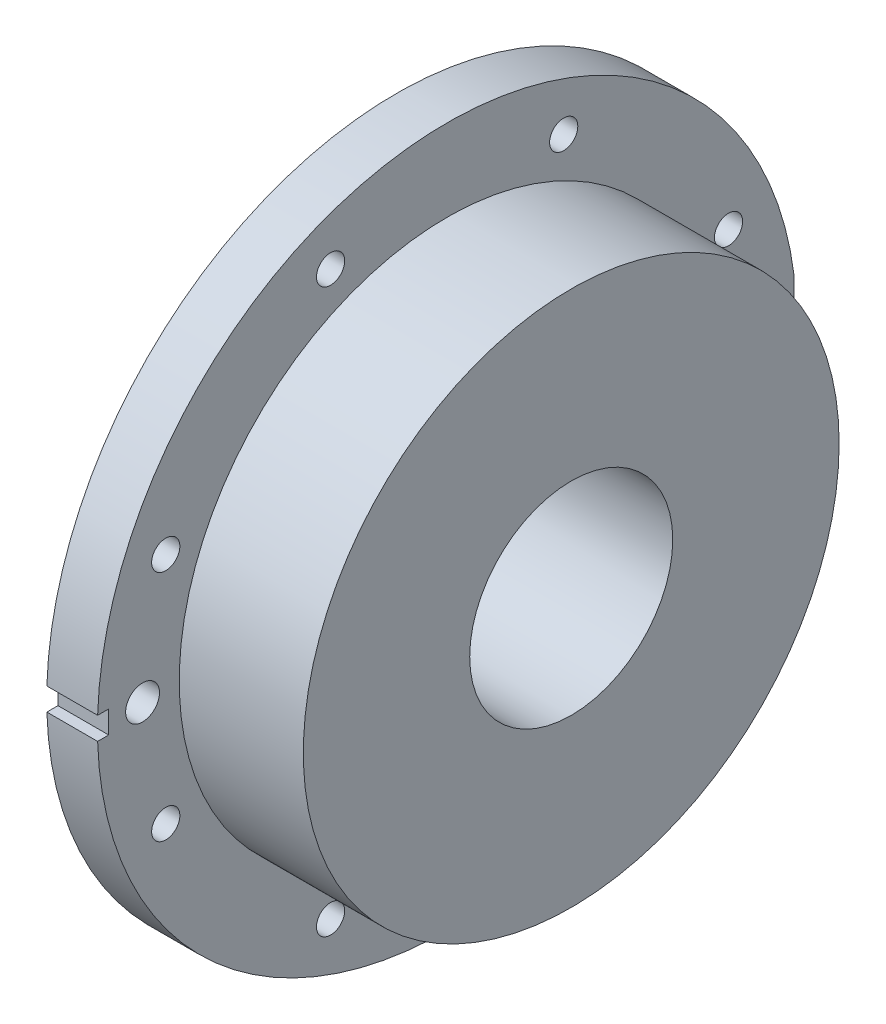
ISO-10303-21;
HEADER;
FILE_DESCRIPTION(('STEP AP214'),'2;1');
FILE_NAME('part.step','',(''),(''),'','','');
FILE_SCHEMA(('AUTOMOTIVE_DESIGN { 1 0 10303 214 1 1 1 1 }'));
ENDSEC;
DATA;
#1=APPLICATION_CONTEXT('core data for automotive mechanical design processes');
#2=APPLICATION_PROTOCOL_DEFINITION('international standard','automotive_design',2000,#1);
#3=PRODUCT_CONTEXT('',#1,'mechanical');
#4=PRODUCT('Part','Part','',(#3));
#5=PRODUCT_RELATED_PRODUCT_CATEGORY('part','',(#4));
#6=PRODUCT_DEFINITION_FORMATION('','',#4);
#7=PRODUCT_DEFINITION_CONTEXT('part definition',#1,'design');
#8=PRODUCT_DEFINITION('design','',#6,#7);
#9=PRODUCT_DEFINITION_SHAPE('','',#8);
#10=(LENGTH_UNIT() NAMED_UNIT(*) SI_UNIT(.MILLI.,.METRE.));
#11=(NAMED_UNIT(*) PLANE_ANGLE_UNIT() SI_UNIT($,.RADIAN.));
#12=(NAMED_UNIT(*) SI_UNIT($,.STERADIAN.) SOLID_ANGLE_UNIT());
#13=UNCERTAINTY_MEASURE_WITH_UNIT(LENGTH_MEASURE(1.E-05),#10,'distance_accuracy_value','');
#14=(GEOMETRIC_REPRESENTATION_CONTEXT(3) GLOBAL_UNCERTAINTY_ASSIGNED_CONTEXT((#13)) GLOBAL_UNIT_ASSIGNED_CONTEXT((#10,
#11,#12)) REPRESENTATION_CONTEXT('',''));
#15=CARTESIAN_POINT('',(0.,0.,0.));
#16=DIRECTION('',(0.,0.,1.));
#17=DIRECTION('',(1.,0.,0.));
#18=AXIS2_PLACEMENT_3D('',#15,#16,#17);
#19=CARTESIAN_POINT('',(0.,0.,0.));
#20=DIRECTION('',(-1.,0.,0.));
#21=DIRECTION('',(0.,0.,1.));
#22=AXIS2_PLACEMENT_3D('',#19,#20,#21);
#23=CYLINDRICAL_SURFACE('',#22,62.);
#24=DIRECTION('',(-1.,0.,0.));
#25=VECTOR('',#24,1.);
#26=CARTESIAN_POINT('',(0.,7.85811682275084,-61.5));
#27=LINE('',#26,#25);
#28=CARTESIAN_POINT('',(9.,7.85811682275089,-61.5));
#29=VERTEX_POINT('',#28);
#30=CARTESIAN_POINT('',(0.,7.85811682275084,-61.5));
#31=VERTEX_POINT('',#30);
#32=EDGE_CURVE('E127',#29,#31,#27,.T.);
#33=ORIENTED_EDGE('',*,*,#32,.T.);
#34=CARTESIAN_POINT('',(0.,0.,0.));
#35=DIRECTION('',(-1.,0.,0.));
#36=DIRECTION('',(0.,0.,1.));
#37=AXIS2_PLACEMENT_3D('',#34,#35,#36);
#38=CIRCLE('',#37,62.);
#39=CARTESIAN_POINT('',(0.,2.,61.9677335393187));
#40=VERTEX_POINT('',#39);
#41=EDGE_CURVE('E138',#40,#31,#38,.T.);
#42=ORIENTED_EDGE('',*,*,#41,.F.);
#43=DIRECTION('',(-1.,0.,0.));
#44=VECTOR('',#43,1.);
#45=CARTESIAN_POINT('',(0.,2.,61.9677335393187));
#46=LINE('',#45,#44);
#47=CARTESIAN_POINT('',(9.,2.,61.9677335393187));
#48=VERTEX_POINT('',#47);
#49=EDGE_CURVE('E47',#40,#48,#46,.F.);
#50=ORIENTED_EDGE('',*,*,#49,.T.);
#51=CARTESIAN_POINT('',(9.,0.,0.));
#52=DIRECTION('',(-1.,0.,0.));
#53=DIRECTION('',(0.,0.,1.));
#54=AXIS2_PLACEMENT_3D('',#51,#52,#53);
#55=CIRCLE('',#54,62.);
#56=EDGE_CURVE('E137',#48,#29,#55,.T.);
#57=ORIENTED_EDGE('',*,*,#56,.T.);
#58=EDGE_LOOP('',(#33,#42,#50,#57));
#59=FACE_BOUND('',#58,.T.);
#60=ADVANCED_FACE('F16',(#59),#23,.T.);
#61=CARTESIAN_POINT('',(0.,0.,0.));
#62=DIRECTION('',(-1.,0.,0.));
#63=DIRECTION('',(0.,0.,1.));
#64=AXIS2_PLACEMENT_3D('',#61,#62,#63);
#65=CYLINDRICAL_SURFACE('',#64,35.);
#66=CARTESIAN_POINT('',(2.,0.,0.));
#67=DIRECTION('',(-1.,0.,0.));
#68=DIRECTION('',(0.,0.,1.));
#69=AXIS2_PLACEMENT_3D('',#66,#67,#68);
#70=CIRCLE('',#69,35.);
#71=CARTESIAN_POINT('',(2.,0.,35.));
#72=VERTEX_POINT('',#71);
#73=EDGE_CURVE('E25',#72,#72,#70,.T.);
#74=ORIENTED_EDGE('',*,*,#73,.F.);
#75=EDGE_LOOP('',(#74));
#76=FACE_BOUND('',#75,.T.);
#77=CARTESIAN_POINT('',(-5.,0.,0.));
#78=DIRECTION('',(-1.,0.,0.));
#79=DIRECTION('',(0.,0.,1.));
#80=AXIS2_PLACEMENT_3D('',#77,#78,#79);
#81=CIRCLE('',#80,35.);
#82=CARTESIAN_POINT('',(-5.,0.,35.));
#83=VERTEX_POINT('',#82);
#84=EDGE_CURVE('E155',#83,#83,#81,.F.);
#85=ORIENTED_EDGE('',*,*,#84,.F.);
#86=EDGE_LOOP('',(#85));
#87=FACE_BOUND('',#86,.T.);
#88=ADVANCED_FACE('F18',(#76,#87),#65,.F.);
#89=CARTESIAN_POINT('',(0.,0.,0.));
#90=DIRECTION('',(-1.,0.,0.));
#91=DIRECTION('',(0.,0.,1.));
#92=AXIS2_PLACEMENT_3D('',#89,#90,#91);
#93=CYLINDRICAL_SURFACE('',#92,18.);
#94=CARTESIAN_POINT('',(2.,0.,0.));
#95=DIRECTION('',(-1.,0.,0.));
#96=DIRECTION('',(0.,0.,1.));
#97=AXIS2_PLACEMENT_3D('',#94,#95,#96);
#98=CIRCLE('',#97,18.);
#99=CARTESIAN_POINT('',(2.,0.,18.));
#100=VERTEX_POINT('',#99);
#101=EDGE_CURVE('E151',#100,#100,#98,.T.);
#102=ORIENTED_EDGE('',*,*,#101,.T.);
#103=EDGE_LOOP('',(#102));
#104=FACE_BOUND('',#103,.T.);
#105=CARTESIAN_POINT('',(31.,0.,0.));
#106=DIRECTION('',(1.,0.,0.));
#107=DIRECTION('',(0.,0.,-1.));
#108=AXIS2_PLACEMENT_3D('',#105,#106,#107);
#109=CIRCLE('',#108,18.);
#110=CARTESIAN_POINT('',(31.,0.,-18.));
#111=VERTEX_POINT('',#110);
#112=EDGE_CURVE('E145',#111,#111,#109,.F.);
#113=ORIENTED_EDGE('',*,*,#112,.F.);
#114=EDGE_LOOP('',(#113));
#115=FACE_BOUND('',#114,.T.);
#116=ADVANCED_FACE('F306',(#104,#115),#93,.F.);
#117=CARTESIAN_POINT('',(2.,35.,0.));
#118=DIRECTION('',(1.,0.,0.));
#119=DIRECTION('',(0.,0.,-1.));
#120=AXIS2_PLACEMENT_3D('',#117,#118,#119);
#121=PLANE('',#120);
#122=ORIENTED_EDGE('',*,*,#101,.F.);
#123=EDGE_LOOP('',(#122));
#124=FACE_BOUND('',#123,.T.);
#125=ORIENTED_EDGE('',*,*,#73,.T.);
#126=EDGE_LOOP('',(#125));
#127=FACE_BOUND('',#126,.T.);
#128=ADVANCED_FACE('F327',(#124,#127),#121,.F.);
#129=CARTESIAN_POINT('',(-5.,42.,0.));
#130=DIRECTION('',(-1.,0.,0.));
#131=DIRECTION('',(0.,0.,1.));
#132=AXIS2_PLACEMENT_3D('',#129,#130,#131);
#133=PLANE('',#132);
#134=CARTESIAN_POINT('',(-5.,0.,0.));
#135=DIRECTION('',(-1.,0.,0.));
#136=DIRECTION('',(0.,0.,1.));
#137=AXIS2_PLACEMENT_3D('',#134,#135,#136);
#138=CIRCLE('',#137,42.);
#139=CARTESIAN_POINT('',(-5.,0.,42.));
#140=VERTEX_POINT('',#139);
#141=EDGE_CURVE('E253',#140,#140,#138,.T.);
#142=ORIENTED_EDGE('',*,*,#141,.T.);
#143=EDGE_LOOP('',(#142));
#144=FACE_BOUND('',#143,.T.);
#145=ORIENTED_EDGE('',*,*,#84,.T.);
#146=EDGE_LOOP('',(#145));
#147=FACE_BOUND('',#146,.T.);
#148=ADVANCED_FACE('F320',(#144,#147),#133,.T.);
#149=CARTESIAN_POINT('',(31.,30.,0.));
#150=DIRECTION('',(1.,0.,0.));
#151=DIRECTION('',(0.,0.,-1.));
#152=AXIS2_PLACEMENT_3D('',#149,#150,#151);
#153=PLANE('',#152);
#154=ORIENTED_EDGE('',*,*,#112,.T.);
#155=EDGE_LOOP('',(#154));
#156=FACE_BOUND('',#155,.T.);
#157=CARTESIAN_POINT('',(31.,0.,0.));
#158=DIRECTION('',(1.,0.,0.));
#159=DIRECTION('',(0.,0.,-1.));
#160=AXIS2_PLACEMENT_3D('',#157,#158,#159);
#161=CIRCLE('',#160,47.5);
#162=CARTESIAN_POINT('',(31.,0.,-47.5));
#163=VERTEX_POINT('',#162);
#164=EDGE_CURVE('E345',#163,#163,#161,.T.);
#165=ORIENTED_EDGE('',*,*,#164,.T.);
#166=EDGE_LOOP('',(#165));
#167=FACE_BOUND('',#166,.T.);
#168=ADVANCED_FACE('F316',(#156,#167),#153,.T.);
#169=CARTESIAN_POINT('',(9.,62.,0.));
#170=DIRECTION('',(1.,0.,0.));
#171=DIRECTION('',(0.,0.,-1.));
#172=AXIS2_PLACEMENT_3D('',#169,#170,#171);
#173=PLANE('',#172);
#174=CARTESIAN_POINT('',(9.,0.,0.));
#175=DIRECTION('',(1.,0.,0.));
#176=DIRECTION('',(0.,0.,-1.));
#177=AXIS2_PLACEMENT_3D('',#174,#175,#176);
#178=CIRCLE('',#177,47.5);
#179=CARTESIAN_POINT('',(9.,0.,-47.5));
#180=VERTEX_POINT('',#179);
#181=EDGE_CURVE('E11',#180,#180,#178,.T.);
#182=ORIENTED_EDGE('',*,*,#181,.F.);
#183=EDGE_LOOP('',(#182));
#184=FACE_BOUND('',#183,.T.);
#185=CARTESIAN_POINT('',(9.,-49.8894947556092,20.6649053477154));
#186=DIRECTION('',(1.,0.,0.));
#187=DIRECTION('',(0.,0.707106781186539,-0.707106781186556));
#188=AXIS2_PLACEMENT_3D('',#185,#186,#187);
#189=CIRCLE('',#188,2.5);
#190=CARTESIAN_POINT('',(9.,-48.1217278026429,18.897138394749));
#191=VERTEX_POINT('',#190);
#192=EDGE_CURVE('E350',#191,#191,#189,.T.);
#193=ORIENTED_EDGE('',*,*,#192,.F.);
#194=EDGE_LOOP('',(#193));
#195=FACE_BOUND('',#194,.T.);
#196=CARTESIAN_POINT('',(9.,-49.8894947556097,-20.6649053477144));
#197=DIRECTION('',(1.,0.,0.));
#198=DIRECTION('',(0.,1.,0.));
#199=AXIS2_PLACEMENT_3D('',#196,#197,#198);
#200=CIRCLE('',#199,2.5);
#201=CARTESIAN_POINT('',(9.,-47.3894947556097,-20.6649053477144));
#202=VERTEX_POINT('',#201);
#203=EDGE_CURVE('E360',#202,#202,#200,.T.);
#204=ORIENTED_EDGE('',*,*,#203,.F.);
#205=EDGE_LOOP('',(#204));
#206=FACE_BOUND('',#205,.T.);
#207=CARTESIAN_POINT('',(9.,-20.6649053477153,-49.8894947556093));
#208=DIRECTION('',(1.,0.,0.));
#209=DIRECTION('',(0.,0.707106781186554,0.707106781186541));
#210=AXIS2_PLACEMENT_3D('',#207,#208,#209);
#211=CIRCLE('',#210,2.5);
#212=CARTESIAN_POINT('',(9.,-18.8971383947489,-48.121727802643));
#213=VERTEX_POINT('',#212);
#214=EDGE_CURVE('E368',#213,#213,#211,.T.);
#215=ORIENTED_EDGE('',*,*,#214,.F.);
#216=EDGE_LOOP('',(#215));
#217=FACE_BOUND('',#216,.T.);
#218=CARTESIAN_POINT('',(9.,20.6649053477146,-49.8894947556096));
#219=DIRECTION('',(1.,0.,0.));
#220=DIRECTION('',(0.,0.,1.));
#221=AXIS2_PLACEMENT_3D('',#218,#219,#220);
#222=CIRCLE('',#221,2.5);
#223=CARTESIAN_POINT('',(9.,20.6649053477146,-47.3894947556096));
#224=VERTEX_POINT('',#223);
#225=EDGE_CURVE('E376',#224,#224,#222,.T.);
#226=ORIENTED_EDGE('',*,*,#225,.F.);
#227=EDGE_LOOP('',(#226));
#228=FACE_BOUND('',#227,.T.);
#229=CARTESIAN_POINT('',(9.,49.8894947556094,-20.6649053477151));
#230=DIRECTION('',(1.,0.,0.));
#231=DIRECTION('',(0.,-0.707106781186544,0.707106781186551));
#232=AXIS2_PLACEMENT_3D('',#229,#230,#231);
#233=CIRCLE('',#232,2.5);
#234=CARTESIAN_POINT('',(9.,48.121727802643,-18.8971383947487));
#235=VERTEX_POINT('',#234);
#236=EDGE_CURVE('E384',#235,#235,#233,.T.);
#237=ORIENTED_EDGE('',*,*,#236,.F.);
#238=EDGE_LOOP('',(#237));
#239=FACE_BOUND('',#238,.T.);
#240=CARTESIAN_POINT('',(9.,49.8894947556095,20.6649053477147));
#241=DIRECTION('',(1.,0.,0.));
#242=DIRECTION('',(0.,-1.,0.));
#243=AXIS2_PLACEMENT_3D('',#240,#241,#242);
#244=CIRCLE('',#243,2.5);
#245=CARTESIAN_POINT('',(9.,47.3894947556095,20.6649053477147));
#246=VERTEX_POINT('',#245);
#247=EDGE_CURVE('E392',#246,#246,#244,.T.);
#248=ORIENTED_EDGE('',*,*,#247,.F.);
#249=EDGE_LOOP('',(#248));
#250=FACE_BOUND('',#249,.T.);
#251=CARTESIAN_POINT('',(9.,20.6649053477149,49.8894947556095));
#252=DIRECTION('',(1.,0.,0.));
#253=DIRECTION('',(0.,-0.707106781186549,-0.707106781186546));
#254=AXIS2_PLACEMENT_3D('',#251,#252,#253);
#255=CIRCLE('',#254,2.5);
#256=CARTESIAN_POINT('',(9.,18.8971383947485,48.1217278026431));
#257=VERTEX_POINT('',#256);
#258=EDGE_CURVE('E175',#257,#257,#255,.T.);
#259=ORIENTED_EDGE('',*,*,#258,.F.);
#260=EDGE_LOOP('',(#259));
#261=FACE_BOUND('',#260,.T.);
#262=CARTESIAN_POINT('',(9.,-20.6649053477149,49.8894947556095));
#263=DIRECTION('',(1.,0.,0.));
#264=DIRECTION('',(0.,0.,-1.));
#265=AXIS2_PLACEMENT_3D('',#262,#263,#264);
#266=CIRCLE('',#265,2.5);
#267=CARTESIAN_POINT('',(9.,-20.6649053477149,47.3894947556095));
#268=VERTEX_POINT('',#267);
#269=EDGE_CURVE('E167',#268,#268,#266,.T.);
#270=ORIENTED_EDGE('',*,*,#269,.F.);
#271=EDGE_LOOP('',(#270));
#272=FACE_BOUND('',#271,.T.);
#273=CARTESIAN_POINT('',(9.,0.,54.));
#274=DIRECTION('',(1.,0.,0.));
#275=DIRECTION('',(0.,0.,-1.));
#276=AXIS2_PLACEMENT_3D('',#273,#274,#275);
#277=CIRCLE('',#276,3.);
#278=CARTESIAN_POINT('',(9.,0.,51.));
#279=VERTEX_POINT('',#278);
#280=EDGE_CURVE('E166',#279,#279,#277,.T.);
#281=ORIENTED_EDGE('',*,*,#280,.F.);
#282=EDGE_LOOP('',(#281));
#283=FACE_BOUND('',#282,.T.);
#284=DIRECTION('',(0.,-1.,0.));
#285=VECTOR('',#284,1.);
#286=CARTESIAN_POINT('',(9.,33.4327683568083,-61.5));
#287=LINE('',#286,#285);
#288=CARTESIAN_POINT('',(9.,3.75,-61.5));
#289=VERTEX_POINT('',#288);
#290=EDGE_CURVE('E116',#29,#289,#287,.T.);
#291=ORIENTED_EDGE('',*,*,#290,.F.);
#292=ORIENTED_EDGE('',*,*,#56,.F.);
#293=DIRECTION('',(0.,0.,-1.));
#294=VECTOR('',#293,1.);
#295=CARTESIAN_POINT('',(9.,2.,70.));
#296=LINE('',#295,#294);
#297=CARTESIAN_POINT('',(9.,2.,60.));
#298=VERTEX_POINT('',#297);
#299=EDGE_CURVE('E247',#48,#298,#296,.T.);
#300=ORIENTED_EDGE('',*,*,#299,.T.);
#301=DIRECTION('',(0.,-1.,0.));
#302=VECTOR('',#301,1.);
#303=CARTESIAN_POINT('',(9.,2.,60.));
#304=LINE('',#303,#302);
#305=CARTESIAN_POINT('',(9.,-2.,60.));
#306=VERTEX_POINT('',#305);
#307=EDGE_CURVE('E228',#298,#306,#304,.T.);
#308=ORIENTED_EDGE('',*,*,#307,.T.);
#309=DIRECTION('',(0.,0.,1.));
#310=VECTOR('',#309,1.);
#311=CARTESIAN_POINT('',(9.,-2.,70.));
#312=LINE('',#311,#310);
#313=CARTESIAN_POINT('',(9.,-2.,61.9677335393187));
#314=VERTEX_POINT('',#313);
#315=EDGE_CURVE('E135',#306,#314,#312,.T.);
#316=ORIENTED_EDGE('',*,*,#315,.T.);
#317=CARTESIAN_POINT('',(9.,-7.8581168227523,-61.5));
#318=VERTEX_POINT('',#317);
#319=EDGE_CURVE('E123',#318,#314,#55,.T.);
#320=ORIENTED_EDGE('',*,*,#319,.F.);
#321=DIRECTION('',(0.,-1.,0.));
#322=VECTOR('',#321,1.);
#323=CARTESIAN_POINT('',(9.,-3.75,-61.5));
#324=LINE('',#323,#322);
#325=CARTESIAN_POINT('',(9.,-3.75,-61.5));
#326=VERTEX_POINT('',#325);
#327=EDGE_CURVE('E106',#326,#318,#324,.T.);
#328=ORIENTED_EDGE('',*,*,#327,.F.);
#329=DIRECTION('',(0.,-0.866025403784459,-0.499999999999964));
#330=VECTOR('',#329,1.);
#331=CARTESIAN_POINT('',(9.,0.,-59.3349364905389));
#332=LINE('',#331,#330);
#333=CARTESIAN_POINT('',(9.,0.,-59.3349364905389));
#334=VERTEX_POINT('',#333);
#335=EDGE_CURVE('E117',#334,#326,#332,.T.);
#336=ORIENTED_EDGE('',*,*,#335,.F.);
#337=DIRECTION('',(0.,-0.866025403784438,0.5));
#338=VECTOR('',#337,1.);
#339=CARTESIAN_POINT('',(9.,3.75,-61.5));
#340=LINE('',#339,#338);
#341=EDGE_CURVE('E202',#289,#334,#340,.T.);
#342=ORIENTED_EDGE('',*,*,#341,.F.);
#343=EDGE_LOOP('',(#291,#292,#300,#308,#316,#320,#328,#336,#342));
#344=FACE_BOUND('',#343,.T.);
#345=ADVANCED_FACE('F132',(#184,#195,#206,#217,#228,#239,#250,#261,#272,#283,#344),#173,.T.);
#346=DIRECTION('',(-1.,0.,0.));
#347=VECTOR('',#346,1.);
#348=CARTESIAN_POINT('',(0.,-7.8581168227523,-61.5));
#349=LINE('',#348,#347);
#350=CARTESIAN_POINT('',(0.,-7.8581168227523,-61.5));
#351=VERTEX_POINT('',#350);
#352=EDGE_CURVE('E109',#351,#318,#349,.F.);
#353=ORIENTED_EDGE('',*,*,#352,.T.);
#354=ORIENTED_EDGE('',*,*,#319,.T.);
#355=DIRECTION('',(-1.,0.,0.));
#356=VECTOR('',#355,1.);
#357=CARTESIAN_POINT('',(0.,-2.,61.9677335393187));
#358=LINE('',#357,#356);
#359=CARTESIAN_POINT('',(0.,-2.,61.9677335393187));
#360=VERTEX_POINT('',#359);
#361=EDGE_CURVE('E225',#314,#360,#358,.T.);
#362=ORIENTED_EDGE('',*,*,#361,.T.);
#363=EDGE_CURVE('E125',#351,#360,#38,.T.);
#364=ORIENTED_EDGE('',*,*,#363,.F.);
#365=EDGE_LOOP('',(#353,#354,#362,#364));
#366=FACE_BOUND('',#365,.T.);
#367=ADVANCED_FACE('F121',(#366),#23,.T.);
#368=CARTESIAN_POINT('',(0.,42.,0.));
#369=DIRECTION('',(-1.,0.,0.));
#370=DIRECTION('',(0.,0.,1.));
#371=AXIS2_PLACEMENT_3D('',#368,#369,#370);
#372=PLANE('',#371);
#373=CARTESIAN_POINT('',(0.,-49.8894947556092,20.6649053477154));
#374=DIRECTION('',(-1.,0.,0.));
#375=DIRECTION('',(0.,-0.707106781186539,0.707106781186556));
#376=AXIS2_PLACEMENT_3D('',#373,#374,#375);
#377=CIRCLE('',#376,2.5);
#378=CARTESIAN_POINT('',(0.,-51.6572617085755,22.4326723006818));
#379=VERTEX_POINT('',#378);
#380=EDGE_CURVE('E347',#379,#379,#377,.T.);
#381=ORIENTED_EDGE('',*,*,#380,.F.);
#382=EDGE_LOOP('',(#381));
#383=FACE_BOUND('',#382,.T.);
#384=CARTESIAN_POINT('',(0.,-49.8894947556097,-20.6649053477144));
#385=DIRECTION('',(-1.,0.,0.));
#386=DIRECTION('',(0.,-1.,0.));
#387=AXIS2_PLACEMENT_3D('',#384,#385,#386);
#388=CIRCLE('',#387,2.5);
#389=CARTESIAN_POINT('',(0.,-52.3894947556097,-20.6649053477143));
#390=VERTEX_POINT('',#389);
#391=EDGE_CURVE('E356',#390,#390,#388,.T.);
#392=ORIENTED_EDGE('',*,*,#391,.F.);
#393=EDGE_LOOP('',(#392));
#394=FACE_BOUND('',#393,.T.);
#395=CARTESIAN_POINT('',(0.,-20.6649053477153,-49.8894947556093));
#396=DIRECTION('',(-1.,0.,0.));
#397=DIRECTION('',(0.,-0.707106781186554,-0.707106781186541));
#398=AXIS2_PLACEMENT_3D('',#395,#396,#397);
#399=CIRCLE('',#398,2.5);
#400=CARTESIAN_POINT('',(0.,-22.4326723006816,-51.6572617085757));
#401=VERTEX_POINT('',#400);
#402=EDGE_CURVE('E364',#401,#401,#399,.T.);
#403=ORIENTED_EDGE('',*,*,#402,.F.);
#404=EDGE_LOOP('',(#403));
#405=FACE_BOUND('',#404,.T.);
#406=CARTESIAN_POINT('',(0.,20.6649053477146,-49.8894947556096));
#407=DIRECTION('',(-1.,0.,0.));
#408=DIRECTION('',(0.,0.,-1.));
#409=AXIS2_PLACEMENT_3D('',#406,#407,#408);
#410=CIRCLE('',#409,2.5);
#411=CARTESIAN_POINT('',(0.,20.6649053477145,-52.3894947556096));
#412=VERTEX_POINT('',#411);
#413=EDGE_CURVE('E372',#412,#412,#410,.T.);
#414=ORIENTED_EDGE('',*,*,#413,.F.);
#415=EDGE_LOOP('',(#414));
#416=FACE_BOUND('',#415,.T.);
#417=CARTESIAN_POINT('',(0.,49.8894947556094,-20.6649053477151));
#418=DIRECTION('',(-1.,0.,0.));
#419=DIRECTION('',(0.,0.707106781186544,-0.707106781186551));
#420=AXIS2_PLACEMENT_3D('',#417,#418,#419);
#421=CIRCLE('',#420,2.5);
#422=CARTESIAN_POINT('',(0.,51.6572617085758,-22.4326723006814));
#423=VERTEX_POINT('',#422);
#424=EDGE_CURVE('E380',#423,#423,#421,.T.);
#425=ORIENTED_EDGE('',*,*,#424,.F.);
#426=EDGE_LOOP('',(#425));
#427=FACE_BOUND('',#426,.T.);
#428=CARTESIAN_POINT('',(0.,49.8894947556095,20.6649053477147));
#429=DIRECTION('',(-1.,0.,0.));
#430=DIRECTION('',(0.,1.,0.));
#431=AXIS2_PLACEMENT_3D('',#428,#429,#430);
#432=CIRCLE('',#431,2.5);
#433=CARTESIAN_POINT('',(0.,52.3894947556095,20.6649053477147));
#434=VERTEX_POINT('',#433);
#435=EDGE_CURVE('E388',#434,#434,#432,.T.);
#436=ORIENTED_EDGE('',*,*,#435,.F.);
#437=EDGE_LOOP('',(#436));
#438=FACE_BOUND('',#437,.T.);
#439=CARTESIAN_POINT('',(0.,20.6649053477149,49.8894947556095));
#440=DIRECTION('',(-1.,0.,0.));
#441=DIRECTION('',(0.,0.707106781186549,0.707106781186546));
#442=AXIS2_PLACEMENT_3D('',#439,#440,#441);
#443=CIRCLE('',#442,2.5);
#444=CARTESIAN_POINT('',(0.,22.4326723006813,51.6572617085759));
#445=VERTEX_POINT('',#444);
#446=EDGE_CURVE('E183',#445,#445,#443,.T.);
#447=ORIENTED_EDGE('',*,*,#446,.F.);
#448=EDGE_LOOP('',(#447));
#449=FACE_BOUND('',#448,.T.);
#450=CARTESIAN_POINT('',(0.,-20.6649053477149,49.8894947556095));
#451=DIRECTION('',(-1.,0.,0.));
#452=DIRECTION('',(0.,0.,1.));
#453=AXIS2_PLACEMENT_3D('',#450,#451,#452);
#454=CIRCLE('',#453,2.5);
#455=CARTESIAN_POINT('',(0.,-20.6649053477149,52.3894947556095));
#456=VERTEX_POINT('',#455);
#457=EDGE_CURVE('E164',#456,#456,#454,.T.);
#458=ORIENTED_EDGE('',*,*,#457,.F.);
#459=EDGE_LOOP('',(#458));
#460=FACE_BOUND('',#459,.T.);
#461=CARTESIAN_POINT('',(0.,0.,54.));
#462=DIRECTION('',(-1.,0.,0.));
#463=DIRECTION('',(0.,0.,1.));
#464=AXIS2_PLACEMENT_3D('',#461,#462,#463);
#465=CIRCLE('',#464,3.);
#466=CARTESIAN_POINT('',(0.,0.,57.));
#467=VERTEX_POINT('',#466);
#468=EDGE_CURVE('E128',#467,#467,#465,.T.);
#469=ORIENTED_EDGE('',*,*,#468,.F.);
#470=EDGE_LOOP('',(#469));
#471=FACE_BOUND('',#470,.T.);
#472=DIRECTION('',(0.,-1.,0.));
#473=VECTOR('',#472,1.);
#474=CARTESIAN_POINT('',(0.,33.4327683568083,-61.5));
#475=LINE('',#474,#473);
#476=CARTESIAN_POINT('',(0.,3.75,-61.5));
#477=VERTEX_POINT('',#476);
#478=EDGE_CURVE('E198',#31,#477,#475,.T.);
#479=ORIENTED_EDGE('',*,*,#478,.T.);
#480=DIRECTION('',(0.,-0.866025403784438,0.5));
#481=VECTOR('',#480,1.);
#482=CARTESIAN_POINT('',(0.,3.75,-61.5));
#483=LINE('',#482,#481);
#484=CARTESIAN_POINT('',(0.,0.,-59.3349364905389));
#485=VERTEX_POINT('',#484);
#486=EDGE_CURVE('E194',#477,#485,#483,.T.);
#487=ORIENTED_EDGE('',*,*,#486,.T.);
#488=DIRECTION('',(0.,-0.866025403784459,-0.499999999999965));
#489=VECTOR('',#488,1.);
#490=CARTESIAN_POINT('',(0.,0.,-59.3349364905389));
#491=LINE('',#490,#489);
#492=CARTESIAN_POINT('',(0.,-3.75,-61.5));
#493=VERTEX_POINT('',#492);
#494=EDGE_CURVE('E215',#485,#493,#491,.T.);
#495=ORIENTED_EDGE('',*,*,#494,.T.);
#496=DIRECTION('',(0.,-1.,0.));
#497=VECTOR('',#496,1.);
#498=CARTESIAN_POINT('',(0.,-3.75,-61.5));
#499=LINE('',#498,#497);
#500=EDGE_CURVE('E36',#493,#351,#499,.T.);
#501=ORIENTED_EDGE('',*,*,#500,.T.);
#502=ORIENTED_EDGE('',*,*,#363,.T.);
#503=DIRECTION('',(0.,0.,1.));
#504=VECTOR('',#503,1.);
#505=CARTESIAN_POINT('',(0.,-2.,70.));
#506=LINE('',#505,#504);
#507=CARTESIAN_POINT('',(0.,-2.,60.));
#508=VERTEX_POINT('',#507);
#509=EDGE_CURVE('E240',#508,#360,#506,.T.);
#510=ORIENTED_EDGE('',*,*,#509,.F.);
#511=DIRECTION('',(0.,-1.,0.));
#512=VECTOR('',#511,1.);
#513=CARTESIAN_POINT('',(0.,2.,60.));
#514=LINE('',#513,#512);
#515=CARTESIAN_POINT('',(0.,2.,60.));
#516=VERTEX_POINT('',#515);
#517=EDGE_CURVE('E236',#516,#508,#514,.T.);
#518=ORIENTED_EDGE('',*,*,#517,.F.);
#519=DIRECTION('',(0.,0.,-1.));
#520=VECTOR('',#519,1.);
#521=CARTESIAN_POINT('',(0.,2.,70.));
#522=LINE('',#521,#520);
#523=EDGE_CURVE('E233',#40,#516,#522,.T.);
#524=ORIENTED_EDGE('',*,*,#523,.F.);
#525=ORIENTED_EDGE('',*,*,#41,.T.);
#526=EDGE_LOOP('',(#479,#487,#495,#501,#502,#510,#518,#524,#525));
#527=FACE_BOUND('',#526,.T.);
#528=CARTESIAN_POINT('',(0.,0.,0.));
#529=DIRECTION('',(-1.,0.,0.));
#530=DIRECTION('',(0.,0.,1.));
#531=AXIS2_PLACEMENT_3D('',#528,#529,#530);
#532=CIRCLE('',#531,42.);
#533=CARTESIAN_POINT('',(0.,0.,42.));
#534=VERTEX_POINT('',#533);
#535=EDGE_CURVE('E256',#534,#534,#532,.T.);
#536=ORIENTED_EDGE('',*,*,#535,.F.);
#537=EDGE_LOOP('',(#536));
#538=FACE_BOUND('',#537,.T.);
#539=ADVANCED_FACE('F266',(#383,#394,#405,#416,#427,#438,#449,#460,#471,#527,#538),#372,.T.);
#540=CARTESIAN_POINT('',(0.,0.,0.));
#541=DIRECTION('',(-1.,0.,0.));
#542=DIRECTION('',(0.,0.,1.));
#543=AXIS2_PLACEMENT_3D('',#540,#541,#542);
#544=CYLINDRICAL_SURFACE('',#543,42.);
#545=ORIENTED_EDGE('',*,*,#535,.T.);
#546=EDGE_LOOP('',(#545));
#547=FACE_BOUND('',#546,.T.);
#548=ORIENTED_EDGE('',*,*,#141,.F.);
#549=EDGE_LOOP('',(#548));
#550=FACE_BOUND('',#549,.T.);
#551=ADVANCED_FACE('F314',(#547,#550),#544,.T.);
#552=CARTESIAN_POINT('',(31.001,-2.,70.));
#553=DIRECTION('',(0.,-1.,0.));
#554=DIRECTION('',(0.,0.,-1.));
#555=AXIS2_PLACEMENT_3D('',#552,#553,#554);
#556=PLANE('',#555);
#557=DIRECTION('',(-1.,0.,0.));
#558=VECTOR('',#557,1.);
#559=CARTESIAN_POINT('',(31.001,-2.,60.));
#560=LINE('',#559,#558);
#561=EDGE_CURVE('E244',#306,#508,#560,.T.);
#562=ORIENTED_EDGE('',*,*,#561,.T.);
#563=ORIENTED_EDGE('',*,*,#509,.T.);
#564=ORIENTED_EDGE('',*,*,#361,.F.);
#565=ORIENTED_EDGE('',*,*,#315,.F.);
#566=EDGE_LOOP('',(#562,#563,#564,#565));
#567=FACE_BOUND('',#566,.T.);
#568=ADVANCED_FACE('F270',(#567),#556,.F.);
#569=CARTESIAN_POINT('',(31.001,2.,60.));
#570=DIRECTION('',(0.,0.,-1.));
#571=DIRECTION('',(-1.,0.,0.));
#572=AXIS2_PLACEMENT_3D('',#569,#570,#571);
#573=PLANE('',#572);
#574=DIRECTION('',(-1.,0.,0.));
#575=VECTOR('',#574,1.);
#576=CARTESIAN_POINT('',(31.001,2.,60.));
#577=LINE('',#576,#575);
#578=EDGE_CURVE('E243',#298,#516,#577,.T.);
#579=ORIENTED_EDGE('',*,*,#578,.T.);
#580=ORIENTED_EDGE('',*,*,#517,.T.);
#581=ORIENTED_EDGE('',*,*,#561,.F.);
#582=ORIENTED_EDGE('',*,*,#307,.F.);
#583=EDGE_LOOP('',(#579,#580,#581,#582));
#584=FACE_BOUND('',#583,.T.);
#585=ADVANCED_FACE('F273',(#584),#573,.F.);
#586=CARTESIAN_POINT('',(31.001,2.,70.));
#587=DIRECTION('',(0.,1.,0.));
#588=DIRECTION('',(0.,0.,1.));
#589=AXIS2_PLACEMENT_3D('',#586,#587,#588);
#590=PLANE('',#589);
#591=ORIENTED_EDGE('',*,*,#49,.F.);
#592=ORIENTED_EDGE('',*,*,#523,.T.);
#593=ORIENTED_EDGE('',*,*,#578,.F.);
#594=ORIENTED_EDGE('',*,*,#299,.F.);
#595=EDGE_LOOP('',(#591,#592,#593,#594));
#596=FACE_BOUND('',#595,.T.);
#597=ADVANCED_FACE('F426',(#596),#590,.F.);
#598=CARTESIAN_POINT('',(-5.001,3.75,-61.5));
#599=DIRECTION('',(0.,0.5,0.866025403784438));
#600=DIRECTION('',(0.,-0.866025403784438,0.5));
#601=AXIS2_PLACEMENT_3D('',#598,#599,#600);
#602=PLANE('',#601);
#603=DIRECTION('',(1.,0.,0.));
#604=VECTOR('',#603,1.);
#605=CARTESIAN_POINT('',(-5.001,3.75,-61.5));
#606=LINE('',#605,#604);
#607=EDGE_CURVE('E212',#477,#289,#606,.T.);
#608=ORIENTED_EDGE('',*,*,#607,.T.);
#609=ORIENTED_EDGE('',*,*,#341,.T.);
#610=DIRECTION('',(1.,0.,0.));
#611=VECTOR('',#610,1.);
#612=CARTESIAN_POINT('',(-5.001,0.,-59.3349364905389));
#613=LINE('',#612,#611);
#614=EDGE_CURVE('E211',#485,#334,#613,.T.);
#615=ORIENTED_EDGE('',*,*,#614,.F.);
#616=ORIENTED_EDGE('',*,*,#486,.F.);
#617=EDGE_LOOP('',(#608,#609,#615,#616));
#618=FACE_BOUND('',#617,.T.);
#619=ADVANCED_FACE('F281',(#618),#602,.F.);
#620=CARTESIAN_POINT('',(-5.001,33.4327683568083,-61.5));
#621=DIRECTION('',(0.,0.,1.));
#622=DIRECTION('',(1.,0.,0.));
#623=AXIS2_PLACEMENT_3D('',#620,#621,#622);
#624=PLANE('',#623);
#625=ORIENTED_EDGE('',*,*,#290,.T.);
#626=ORIENTED_EDGE('',*,*,#607,.F.);
#627=ORIENTED_EDGE('',*,*,#478,.F.);
#628=ORIENTED_EDGE('',*,*,#32,.F.);
#629=EDGE_LOOP('',(#625,#626,#627,#628));
#630=FACE_BOUND('',#629,.T.);
#631=ADVANCED_FACE('F278',(#630),#624,.F.);
#632=CARTESIAN_POINT('',(-5.001,-3.75,-61.5));
#633=DIRECTION('',(0.,0.,1.));
#634=DIRECTION('',(0.,-1.,0.));
#635=AXIS2_PLACEMENT_3D('',#632,#633,#634);
#636=PLANE('',#635);
#637=ORIENTED_EDGE('',*,*,#500,.F.);
#638=DIRECTION('',(1.,0.,0.));
#639=VECTOR('',#638,1.);
#640=CARTESIAN_POINT('',(-5.001,-3.75,-61.5));
#641=LINE('',#640,#639);
#642=EDGE_CURVE('E110',#493,#326,#641,.T.);
#643=ORIENTED_EDGE('',*,*,#642,.T.);
#644=ORIENTED_EDGE('',*,*,#327,.T.);
#645=ORIENTED_EDGE('',*,*,#352,.F.);
#646=EDGE_LOOP('',(#637,#643,#644,#645));
#647=FACE_BOUND('',#646,.T.);
#648=ADVANCED_FACE('F108',(#647),#636,.F.);
#649=CARTESIAN_POINT('',(-5.001,0.,-59.3349364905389));
#650=DIRECTION('',(0.,-0.499999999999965,0.866025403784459));
#651=DIRECTION('',(0.,-0.866025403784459,-0.499999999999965));
#652=AXIS2_PLACEMENT_3D('',#649,#650,#651);
#653=PLANE('',#652);
#654=ORIENTED_EDGE('',*,*,#614,.T.);
#655=ORIENTED_EDGE('',*,*,#335,.T.);
#656=ORIENTED_EDGE('',*,*,#642,.F.);
#657=ORIENTED_EDGE('',*,*,#494,.F.);
#658=EDGE_LOOP('',(#654,#655,#656,#657));
#659=FACE_BOUND('',#658,.T.);
#660=ADVANCED_FACE('F285',(#659),#653,.F.);
#661=CARTESIAN_POINT('',(9.,0.,54.));
#662=DIRECTION('',(1.,0.,0.));
#663=DIRECTION('',(0.,0.,-1.));
#664=AXIS2_PLACEMENT_3D('',#661,#662,#663);
#665=CYLINDRICAL_SURFACE('',#664,3.);
#666=ORIENTED_EDGE('',*,*,#280,.T.);
#667=EDGE_LOOP('',(#666));
#668=FACE_BOUND('',#667,.T.);
#669=ORIENTED_EDGE('',*,*,#468,.T.);
#670=EDGE_LOOP('',(#669));
#671=FACE_BOUND('',#670,.T.);
#672=ADVANCED_FACE('F287',(#668,#671),#665,.F.);
#673=CARTESIAN_POINT('',(9.,-20.6649053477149,49.8894947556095));
#674=DIRECTION('',(1.,0.,0.));
#675=DIRECTION('',(0.,0.,-1.));
#676=AXIS2_PLACEMENT_3D('',#673,#674,#675);
#677=CYLINDRICAL_SURFACE('',#676,2.5);
#678=ORIENTED_EDGE('',*,*,#457,.T.);
#679=EDGE_LOOP('',(#678));
#680=FACE_BOUND('',#679,.T.);
#681=ORIENTED_EDGE('',*,*,#269,.T.);
#682=EDGE_LOOP('',(#681));
#683=FACE_BOUND('',#682,.T.);
#684=ADVANCED_FACE('F294',(#680,#683),#677,.F.);
#685=CARTESIAN_POINT('',(9.,20.6649053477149,49.8894947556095));
#686=DIRECTION('',(1.,0.,0.));
#687=DIRECTION('',(0.,-0.707106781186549,-0.707106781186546));
#688=AXIS2_PLACEMENT_3D('',#685,#686,#687);
#689=CYLINDRICAL_SURFACE('',#688,2.5);
#690=ORIENTED_EDGE('',*,*,#446,.T.);
#691=EDGE_LOOP('',(#690));
#692=FACE_BOUND('',#691,.T.);
#693=ORIENTED_EDGE('',*,*,#258,.T.);
#694=EDGE_LOOP('',(#693));
#695=FACE_BOUND('',#694,.T.);
#696=ADVANCED_FACE('F398',(#692,#695),#689,.F.);
#697=CARTESIAN_POINT('',(9.,49.8894947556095,20.6649053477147));
#698=DIRECTION('',(1.,0.,0.));
#699=DIRECTION('',(0.,-1.,0.));
#700=AXIS2_PLACEMENT_3D('',#697,#698,#699);
#701=CYLINDRICAL_SURFACE('',#700,2.5);
#702=ORIENTED_EDGE('',*,*,#435,.T.);
#703=EDGE_LOOP('',(#702));
#704=FACE_BOUND('',#703,.T.);
#705=ORIENTED_EDGE('',*,*,#247,.T.);
#706=EDGE_LOOP('',(#705));
#707=FACE_BOUND('',#706,.T.);
#708=ADVANCED_FACE('F406',(#704,#707),#701,.F.);
#709=CARTESIAN_POINT('',(9.,49.8894947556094,-20.6649053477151));
#710=DIRECTION('',(1.,0.,0.));
#711=DIRECTION('',(0.,-0.707106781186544,0.707106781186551));
#712=AXIS2_PLACEMENT_3D('',#709,#710,#711);
#713=CYLINDRICAL_SURFACE('',#712,2.5);
#714=ORIENTED_EDGE('',*,*,#424,.T.);
#715=EDGE_LOOP('',(#714));
#716=FACE_BOUND('',#715,.T.);
#717=ORIENTED_EDGE('',*,*,#236,.T.);
#718=EDGE_LOOP('',(#717));
#719=FACE_BOUND('',#718,.T.);
#720=ADVANCED_FACE('F418',(#716,#719),#713,.F.);
#721=CARTESIAN_POINT('',(9.,20.6649053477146,-49.8894947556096));
#722=DIRECTION('',(1.,0.,0.));
#723=DIRECTION('',(0.,0.,1.));
#724=AXIS2_PLACEMENT_3D('',#721,#722,#723);
#725=CYLINDRICAL_SURFACE('',#724,2.5);
#726=ORIENTED_EDGE('',*,*,#413,.T.);
#727=EDGE_LOOP('',(#726));
#728=FACE_BOUND('',#727,.T.);
#729=ORIENTED_EDGE('',*,*,#225,.T.);
#730=EDGE_LOOP('',(#729));
#731=FACE_BOUND('',#730,.T.);
#732=ADVANCED_FACE('F502',(#728,#731),#725,.F.);
#733=CARTESIAN_POINT('',(9.,-20.6649053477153,-49.8894947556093));
#734=DIRECTION('',(1.,0.,0.));
#735=DIRECTION('',(0.,0.707106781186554,0.707106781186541));
#736=AXIS2_PLACEMENT_3D('',#733,#734,#735);
#737=CYLINDRICAL_SURFACE('',#736,2.5);
#738=ORIENTED_EDGE('',*,*,#402,.T.);
#739=EDGE_LOOP('',(#738));
#740=FACE_BOUND('',#739,.T.);
#741=ORIENTED_EDGE('',*,*,#214,.T.);
#742=EDGE_LOOP('',(#741));
#743=FACE_BOUND('',#742,.T.);
#744=ADVANCED_FACE('F511',(#740,#743),#737,.F.);
#745=CARTESIAN_POINT('',(9.,-49.8894947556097,-20.6649053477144));
#746=DIRECTION('',(1.,0.,0.));
#747=DIRECTION('',(0.,1.,0.));
#748=AXIS2_PLACEMENT_3D('',#745,#746,#747);
#749=CYLINDRICAL_SURFACE('',#748,2.5);
#750=ORIENTED_EDGE('',*,*,#391,.T.);
#751=EDGE_LOOP('',(#750));
#752=FACE_BOUND('',#751,.T.);
#753=ORIENTED_EDGE('',*,*,#203,.T.);
#754=EDGE_LOOP('',(#753));
#755=FACE_BOUND('',#754,.T.);
#756=ADVANCED_FACE('F521',(#752,#755),#749,.F.);
#757=CARTESIAN_POINT('',(9.,-49.8894947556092,20.6649053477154));
#758=DIRECTION('',(1.,0.,0.));
#759=DIRECTION('',(0.,0.707106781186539,-0.707106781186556));
#760=AXIS2_PLACEMENT_3D('',#757,#758,#759);
#761=CYLINDRICAL_SURFACE('',#760,2.5);
#762=ORIENTED_EDGE('',*,*,#380,.T.);
#763=EDGE_LOOP('',(#762));
#764=FACE_BOUND('',#763,.T.);
#765=ORIENTED_EDGE('',*,*,#192,.T.);
#766=EDGE_LOOP('',(#765));
#767=FACE_BOUND('',#766,.T.);
#768=ADVANCED_FACE('F531',(#764,#767),#761,.F.);
#769=CARTESIAN_POINT('',(-125.350288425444,0.,0.));
#770=DIRECTION('',(1.,0.,0.));
#771=DIRECTION('',(0.,0.,-1.));
#772=AXIS2_PLACEMENT_3D('',#769,#770,#771);
#773=CYLINDRICAL_SURFACE('',#772,47.5);
#774=ORIENTED_EDGE('',*,*,#181,.T.);
#775=EDGE_LOOP('',(#774));
#776=FACE_BOUND('',#775,.T.);
#777=ORIENTED_EDGE('',*,*,#164,.F.);
#778=EDGE_LOOP('',(#777));
#779=FACE_BOUND('',#778,.T.);
#780=ADVANCED_FACE('F541',(#776,#779),#773,.T.);
#781=CLOSED_SHELL('',(#60,#88,#116,#128,#148,#168,#345,#367,#539,#551,#568,#585,#597,#619,#631,
#648,#660,#672,#684,#696,#708,#720,#732,#744,#756,#768,#780));
#782=MANIFOLD_SOLID_BREP('B1',#781);
#783=ADVANCED_BREP_SHAPE_REPRESENTATION('',(#18,#782),#14);
#784=SHAPE_DEFINITION_REPRESENTATION(#9,#783);
ENDSEC;
END-ISO-10303-21;
